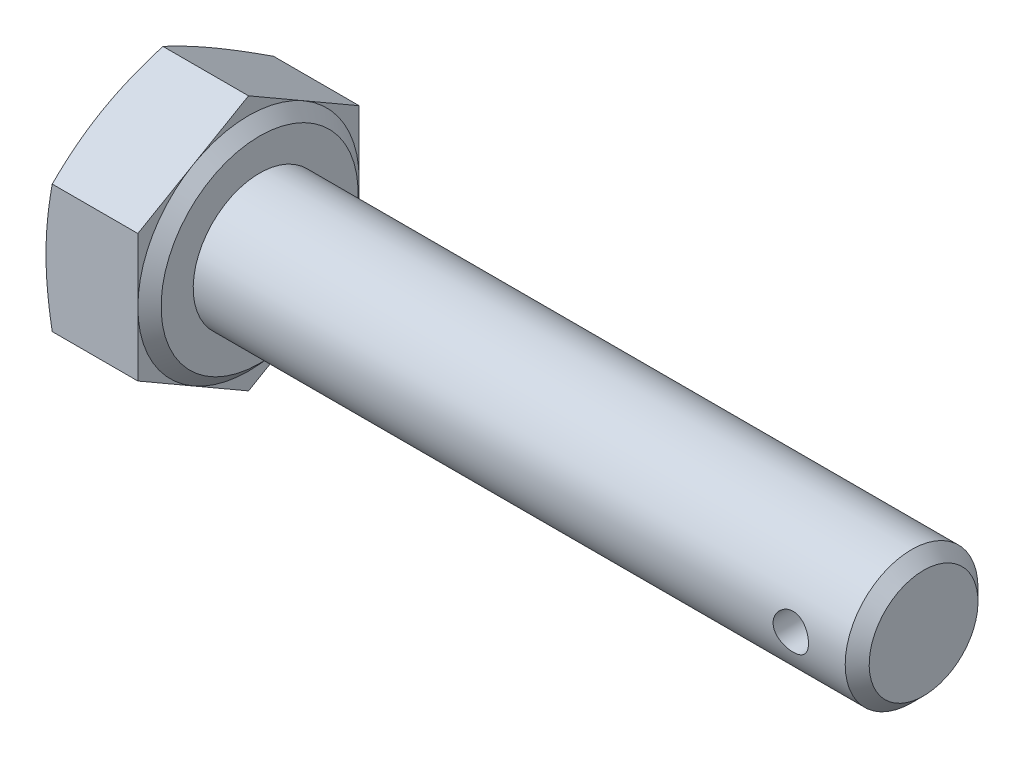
ISO-10303-21;
HEADER;
FILE_DESCRIPTION(('STEP AP214'),'2;1');
FILE_NAME('part.step','',(''),(''),'','','');
FILE_SCHEMA(('AUTOMOTIVE_DESIGN { 1 0 10303 214 1 1 1 1 }'));
ENDSEC;
DATA;
#1=APPLICATION_CONTEXT('core data for automotive mechanical design processes');
#2=APPLICATION_PROTOCOL_DEFINITION('international standard','automotive_design',2000,#1);
#3=PRODUCT_CONTEXT('',#1,'mechanical');
#4=PRODUCT('Part','Part','',(#3));
#5=PRODUCT_RELATED_PRODUCT_CATEGORY('part','',(#4));
#6=PRODUCT_DEFINITION_FORMATION('','',#4);
#7=PRODUCT_DEFINITION_CONTEXT('part definition',#1,'design');
#8=PRODUCT_DEFINITION('design','',#6,#7);
#9=PRODUCT_DEFINITION_SHAPE('','',#8);
#10=(LENGTH_UNIT() NAMED_UNIT(*) SI_UNIT(.MILLI.,.METRE.));
#11=(NAMED_UNIT(*) PLANE_ANGLE_UNIT() SI_UNIT($,.RADIAN.));
#12=(NAMED_UNIT(*) SI_UNIT($,.STERADIAN.) SOLID_ANGLE_UNIT());
#13=UNCERTAINTY_MEASURE_WITH_UNIT(LENGTH_MEASURE(1.E-05),#10,'distance_accuracy_value','');
#14=(GEOMETRIC_REPRESENTATION_CONTEXT(3) GLOBAL_UNCERTAINTY_ASSIGNED_CONTEXT((#13)) GLOBAL_UNIT_ASSIGNED_CONTEXT((#10,
#11,#12)) REPRESENTATION_CONTEXT('',''));
#15=CARTESIAN_POINT('',(0.,0.,0.));
#16=DIRECTION('',(0.,0.,1.));
#17=DIRECTION('',(1.,0.,0.));
#18=AXIS2_PLACEMENT_3D('',#15,#16,#17);
#19=CARTESIAN_POINT('',(4.65,0.,0.));
#20=DIRECTION('',(-1.,0.,0.));
#21=DIRECTION('',(0.,-1.,0.));
#22=AXIS2_PLACEMENT_3D('',#19,#20,#21);
#23=PLANE('',#22);
#24=CARTESIAN_POINT('',(4.65,0.,0.));
#25=DIRECTION('',(-1.,0.,0.));
#26=DIRECTION('',(0.,-1.,0.));
#27=AXIS2_PLACEMENT_3D('',#24,#25,#26);
#28=CIRCLE('',#27,4.45);
#29=CARTESIAN_POINT('',(4.65,-4.44999999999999,0.));
#30=VERTEX_POINT('',#29);
#31=EDGE_CURVE('E150',#30,#30,#28,.T.);
#32=ORIENTED_EDGE('',*,*,#31,.F.);
#33=EDGE_LOOP('',(#32));
#34=FACE_BOUND('',#33,.T.);
#35=CARTESIAN_POINT('',(4.65,0.,0.));
#36=DIRECTION('',(-1.,0.,0.));
#37=DIRECTION('',(0.,-1.,0.));
#38=AXIS2_PLACEMENT_3D('',#35,#36,#37);
#39=CIRCLE('',#38,3.);
#40=CARTESIAN_POINT('',(4.65,-3.,0.));
#41=VERTEX_POINT('',#40);
#42=EDGE_CURVE('E140',#41,#41,#39,.F.);
#43=ORIENTED_EDGE('',*,*,#42,.F.);
#44=EDGE_LOOP('',(#43));
#45=FACE_BOUND('',#44,.T.);
#46=ADVANCED_FACE('F37',(#34,#45),#23,.F.);
#47=CARTESIAN_POINT('',(4.15,-8.66025403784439,-5.));
#48=DIRECTION('',(1.,0.,0.));
#49=DIRECTION('',(0.,0.,-1.));
#50=AXIS2_PLACEMENT_3D('',#47,#48,#49);
#51=PLANE('',#50);
#52=DIRECTION('',(0.,-0.5,-0.866025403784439));
#53=VECTOR('',#52,1.);
#54=CARTESIAN_POINT('',(4.15,-2.88675134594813,5.));
#55=LINE('',#54,#53);
#56=CARTESIAN_POINT('',(4.15,-2.88675134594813,5.));
#57=VERTEX_POINT('',#56);
#58=CARTESIAN_POINT('',(4.15,-4.33012701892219,2.5));
#59=VERTEX_POINT('',#58);
#60=EDGE_CURVE('E149',#57,#59,#55,.T.);
#61=ORIENTED_EDGE('',*,*,#60,.T.);
#62=CARTESIAN_POINT('',(4.15,0.,0.));
#63=DIRECTION('',(-1.,0.,0.));
#64=DIRECTION('',(0.,-1.,0.));
#65=AXIS2_PLACEMENT_3D('',#62,#63,#64);
#66=CIRCLE('',#65,5.);
#67=CARTESIAN_POINT('',(4.15,0.,5.));
#68=VERTEX_POINT('',#67);
#69=EDGE_CURVE('E59',#59,#68,#66,.T.);
#70=ORIENTED_EDGE('',*,*,#69,.T.);
#71=DIRECTION('',(0.,-1.,0.));
#72=VECTOR('',#71,1.);
#73=CARTESIAN_POINT('',(4.15,2.88675134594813,5.));
#74=LINE('',#73,#72);
#75=EDGE_CURVE('E146',#68,#57,#74,.T.);
#76=ORIENTED_EDGE('',*,*,#75,.T.);
#77=EDGE_LOOP('',(#61,#70,#76));
#78=FACE_BOUND('',#77,.T.);
#79=ADVANCED_FACE('F145',(#78),#51,.T.);
#80=CARTESIAN_POINT('',(4.15,2.88675134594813,5.));
#81=VERTEX_POINT('',#80);
#82=EDGE_CURVE('E157',#81,#68,#74,.T.);
#83=ORIENTED_EDGE('',*,*,#82,.T.);
#84=CARTESIAN_POINT('',(4.15,4.3301270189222,2.5));
#85=VERTEX_POINT('',#84);
#86=EDGE_CURVE('E132',#68,#85,#66,.T.);
#87=ORIENTED_EDGE('',*,*,#86,.T.);
#88=DIRECTION('',(0.,-0.5,0.866025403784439));
#89=VECTOR('',#88,1.);
#90=CARTESIAN_POINT('',(4.15,5.77350269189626,0.));
#91=LINE('',#90,#89);
#92=EDGE_CURVE('E163',#85,#81,#91,.T.);
#93=ORIENTED_EDGE('',*,*,#92,.T.);
#94=EDGE_LOOP('',(#83,#87,#93));
#95=FACE_BOUND('',#94,.T.);
#96=ADVANCED_FACE('F162',(#95),#51,.T.);
#97=CARTESIAN_POINT('',(4.15,5.77350269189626,0.));
#98=VERTEX_POINT('',#97);
#99=EDGE_CURVE('E160',#98,#85,#91,.T.);
#100=ORIENTED_EDGE('',*,*,#99,.T.);
#101=CARTESIAN_POINT('',(4.15,4.3301270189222,-2.5));
#102=VERTEX_POINT('',#101);
#103=EDGE_CURVE('E136',#85,#102,#66,.T.);
#104=ORIENTED_EDGE('',*,*,#103,.T.);
#105=DIRECTION('',(0.,0.5,0.866025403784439));
#106=VECTOR('',#105,1.);
#107=CARTESIAN_POINT('',(4.15,2.88675134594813,-5.));
#108=LINE('',#107,#106);
#109=EDGE_CURVE('E318',#102,#98,#108,.T.);
#110=ORIENTED_EDGE('',*,*,#109,.T.);
#111=EDGE_LOOP('',(#100,#104,#110));
#112=FACE_BOUND('',#111,.T.);
#113=ADVANCED_FACE('F328',(#112),#51,.T.);
#114=CARTESIAN_POINT('',(4.15,2.88675134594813,-5.));
#115=VERTEX_POINT('',#114);
#116=EDGE_CURVE('E319',#115,#102,#108,.T.);
#117=ORIENTED_EDGE('',*,*,#116,.T.);
#118=CARTESIAN_POINT('',(4.15,0.,-5.));
#119=VERTEX_POINT('',#118);
#120=EDGE_CURVE('E385',#102,#119,#66,.T.);
#121=ORIENTED_EDGE('',*,*,#120,.T.);
#122=DIRECTION('',(0.,1.,0.));
#123=VECTOR('',#122,1.);
#124=CARTESIAN_POINT('',(4.15,-2.88675134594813,-5.));
#125=LINE('',#124,#123);
#126=EDGE_CURVE('E313',#119,#115,#125,.T.);
#127=ORIENTED_EDGE('',*,*,#126,.T.);
#128=EDGE_LOOP('',(#117,#121,#127));
#129=FACE_BOUND('',#128,.T.);
#130=ADVANCED_FACE('F387',(#129),#51,.T.);
#131=CARTESIAN_POINT('',(4.15,-2.88675134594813,-5.));
#132=VERTEX_POINT('',#131);
#133=EDGE_CURVE('E315',#132,#119,#125,.T.);
#134=ORIENTED_EDGE('',*,*,#133,.T.);
#135=CARTESIAN_POINT('',(4.15,-4.33012701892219,-2.5));
#136=VERTEX_POINT('',#135);
#137=EDGE_CURVE('E383',#119,#136,#66,.T.);
#138=ORIENTED_EDGE('',*,*,#137,.T.);
#139=DIRECTION('',(0.,0.5,-0.866025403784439));
#140=VECTOR('',#139,1.);
#141=CARTESIAN_POINT('',(4.15,-5.77350269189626,0.));
#142=LINE('',#141,#140);
#143=EDGE_CURVE('E312',#136,#132,#142,.T.);
#144=ORIENTED_EDGE('',*,*,#143,.T.);
#145=EDGE_LOOP('',(#134,#138,#144));
#146=FACE_BOUND('',#145,.T.);
#147=ADVANCED_FACE('F295',(#146),#51,.T.);
#148=CARTESIAN_POINT('',(4.15,-5.77350269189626,0.));
#149=VERTEX_POINT('',#148);
#150=EDGE_CURVE('E310',#149,#136,#142,.T.);
#151=ORIENTED_EDGE('',*,*,#150,.T.);
#152=EDGE_CURVE('E151',#136,#59,#66,.T.);
#153=ORIENTED_EDGE('',*,*,#152,.T.);
#154=EDGE_CURVE('E374',#59,#149,#55,.T.);
#155=ORIENTED_EDGE('',*,*,#154,.T.);
#156=EDGE_LOOP('',(#151,#153,#155));
#157=FACE_BOUND('',#156,.T.);
#158=ADVANCED_FACE('F221',(#157),#51,.T.);
#159=CARTESIAN_POINT('',(4.15,-2.88675134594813,5.));
#160=DIRECTION('',(0.,0.866025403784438,-0.5));
#161=DIRECTION('',(0.,0.5,0.866025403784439));
#162=AXIS2_PLACEMENT_3D('',#159,#160,#161);
#163=PLANE('',#162);
#164=CARTESIAN_POINT('',(0.281573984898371,-5.7736181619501,-0.000199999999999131));
#165=CARTESIAN_POINT('',(0.238042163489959,-5.65406193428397,0.206877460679));
#166=CARTESIAN_POINT('',(0.198442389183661,-5.5341114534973,0.414637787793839));
#167=CARTESIAN_POINT('',(0.128772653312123,-5.29343053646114,0.831509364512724));
#168=CARTESIAN_POINT('',(0.0987101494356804,-5.17269956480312,1.04062154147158));
#169=CARTESIAN_POINT('',(0.0500848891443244,-4.93179754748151,1.45787607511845));
#170=CARTESIAN_POINT('',(0.0314160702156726,-4.81163200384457,1.66600890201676));
#171=CARTESIAN_POINT('',(0.00637593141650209,-4.57101989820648,2.08276129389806));
#172=CARTESIAN_POINT('',(0.,-4.45057345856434,2.29138064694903));
#173=CARTESIAN_POINT('',(0.,-4.20968057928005,2.70861935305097));
#174=CARTESIAN_POINT('',(0.00637593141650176,-4.08923413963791,2.91723870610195));
#175=CARTESIAN_POINT('',(0.0314160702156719,-3.84862203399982,3.33399109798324));
#176=CARTESIAN_POINT('',(0.0500848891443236,-3.72845649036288,3.54212392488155));
#177=CARTESIAN_POINT('',(0.0987101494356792,-3.48755447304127,3.95937845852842));
#178=CARTESIAN_POINT('',(0.128772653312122,-3.36682350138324,4.16849063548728));
#179=CARTESIAN_POINT('',(0.19844238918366,-3.12614258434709,4.58536221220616));
#180=CARTESIAN_POINT('',(0.238042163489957,-3.00619210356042,4.793122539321));
#181=CARTESIAN_POINT('',(0.28157398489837,-2.88663587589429,5.0002));
#182=B_SPLINE_CURVE_WITH_KNOTS('',3,(#164,#165,#166,#167,#168,#169,#170,#171,#172,#173,#174,
#175,#176,#177,#178,#179,#180,#181),.UNSPECIFIED.,.F.,.F.,(4,2,2,2,2,2,2,2,4),(0.,
0.729203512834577,1.45897583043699,2.18184682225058,2.90444658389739,3.6270463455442,
4.3499173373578,5.07968965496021,5.80889316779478),.UNSPECIFIED.);
#183=CARTESIAN_POINT('',(0.281531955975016,-5.77350269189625,0.));
#184=VERTEX_POINT('',#183);
#185=CARTESIAN_POINT('',(0.,-4.33012701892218,2.5));
#186=VERTEX_POINT('',#185);
#187=EDGE_CURVE('E300',#184,#186,#182,.T.);
#188=ORIENTED_EDGE('',*,*,#187,.F.);
#189=DIRECTION('',(-1.,0.,0.));
#190=VECTOR('',#189,1.);
#191=CARTESIAN_POINT('',(4.15,-5.77350269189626,0.));
#192=LINE('',#191,#190);
#193=EDGE_CURVE('E180',#149,#184,#192,.T.);
#194=ORIENTED_EDGE('',*,*,#193,.F.);
#195=ORIENTED_EDGE('',*,*,#154,.F.);
#196=ORIENTED_EDGE('',*,*,#60,.F.);
#197=DIRECTION('',(-1.,0.,0.));
#198=VECTOR('',#197,1.);
#199=CARTESIAN_POINT('',(4.15,-2.88675134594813,5.));
#200=LINE('',#199,#198);
#201=CARTESIAN_POINT('',(0.281531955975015,-2.88675134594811,5.));
#202=VERTEX_POINT('',#201);
#203=EDGE_CURVE('E159',#57,#202,#200,.T.);
#204=ORIENTED_EDGE('',*,*,#203,.T.);
#205=EDGE_CURVE('E256',#186,#202,#182,.T.);
#206=ORIENTED_EDGE('',*,*,#205,.F.);
#207=EDGE_LOOP('',(#188,#194,#195,#196,#204,#206));
#208=FACE_BOUND('',#207,.T.);
#209=ADVANCED_FACE('F286',(#208),#163,.F.);
#210=CARTESIAN_POINT('',(4.15,-5.77350269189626,0.));
#211=DIRECTION('',(0.,0.866025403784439,0.5));
#212=DIRECTION('',(0.,-0.5,0.866025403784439));
#213=AXIS2_PLACEMENT_3D('',#210,#211,#212);
#214=PLANE('',#213);
#215=CARTESIAN_POINT('',(0.281573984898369,-2.8866358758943,-5.0002));
#216=CARTESIAN_POINT('',(0.238042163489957,-3.00619210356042,-4.793122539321));
#217=CARTESIAN_POINT('',(0.19844238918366,-3.1261425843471,-4.58536221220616));
#218=CARTESIAN_POINT('',(0.128772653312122,-3.36682350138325,-4.16849063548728));
#219=CARTESIAN_POINT('',(0.0987101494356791,-3.48755447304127,-3.95937845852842));
#220=CARTESIAN_POINT('',(0.0500848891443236,-3.72845649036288,-3.54212392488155));
#221=CARTESIAN_POINT('',(0.0314160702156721,-3.84862203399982,-3.33399109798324));
#222=CARTESIAN_POINT('',(0.00637593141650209,-4.08923413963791,-2.91723870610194));
#223=CARTESIAN_POINT('',(0.,-4.20968057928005,-2.70861935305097));
#224=CARTESIAN_POINT('',(0.,-4.45057345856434,-2.29138064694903));
#225=CARTESIAN_POINT('',(0.00637593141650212,-4.57101989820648,-2.08276129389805));
#226=CARTESIAN_POINT('',(0.0314160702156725,-4.81163200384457,-1.66600890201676));
#227=CARTESIAN_POINT('',(0.0500848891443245,-4.93179754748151,-1.45787607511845));
#228=CARTESIAN_POINT('',(0.0987101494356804,-5.17269956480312,-1.04062154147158));
#229=CARTESIAN_POINT('',(0.128772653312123,-5.29343053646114,-0.831509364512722));
#230=CARTESIAN_POINT('',(0.198442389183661,-5.5341114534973,-0.414637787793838));
#231=CARTESIAN_POINT('',(0.238042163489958,-5.65406193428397,-0.206877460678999));
#232=CARTESIAN_POINT('',(0.281573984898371,-5.7736181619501,0.000200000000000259));
#233=B_SPLINE_CURVE_WITH_KNOTS('',3,(#215,#216,#217,#218,#219,#220,#221,#222,#223,#224,#225,
#226,#227,#228,#229,#230,#231,#232),.UNSPECIFIED.,.F.,.F.,(4,2,2,2,2,2,2,2,4),(0.,
0.729203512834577,1.45897583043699,2.18184682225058,2.90444658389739,3.6270463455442,
4.34991733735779,5.0796896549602,5.80889316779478),.UNSPECIFIED.);
#234=CARTESIAN_POINT('',(0.281531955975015,-2.88675134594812,-5.));
#235=VERTEX_POINT('',#234);
#236=CARTESIAN_POINT('',(0.,-4.33012701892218,-2.5));
#237=VERTEX_POINT('',#236);
#238=EDGE_CURVE('E274',#235,#237,#233,.T.);
#239=ORIENTED_EDGE('',*,*,#238,.F.);
#240=DIRECTION('',(-1.,0.,0.));
#241=VECTOR('',#240,1.);
#242=CARTESIAN_POINT('',(4.15,-2.88675134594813,-5.));
#243=LINE('',#242,#241);
#244=EDGE_CURVE('E177',#132,#235,#243,.T.);
#245=ORIENTED_EDGE('',*,*,#244,.F.);
#246=ORIENTED_EDGE('',*,*,#143,.F.);
#247=ORIENTED_EDGE('',*,*,#150,.F.);
#248=ORIENTED_EDGE('',*,*,#193,.T.);
#249=EDGE_CURVE('E268',#237,#184,#233,.T.);
#250=ORIENTED_EDGE('',*,*,#249,.F.);
#251=EDGE_LOOP('',(#239,#245,#246,#247,#248,#250));
#252=FACE_BOUND('',#251,.T.);
#253=ADVANCED_FACE('F282',(#252),#214,.F.);
#254=CARTESIAN_POINT('',(4.15,-2.88675134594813,-5.));
#255=DIRECTION('',(0.,0.,1.));
#256=DIRECTION('',(1.,0.,0.));
#257=AXIS2_PLACEMENT_3D('',#254,#255,#256);
#258=PLANE('',#257);
#259=CARTESIAN_POINT('',(1.50439512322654,-7.64310251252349,-5.));
#260=CARTESIAN_POINT('',(1.43551180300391,-7.41688443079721,-5.));
#261=CARTESIAN_POINT('',(1.3674322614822,-7.19041704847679,-5.));
#262=CARTESIAN_POINT('',(1.23332538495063,-6.73685676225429,-5.));
#263=CARTESIAN_POINT('',(1.16729821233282,-6.50976381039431,-5.));
#264=CARTESIAN_POINT('',(1.03763088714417,-6.05443677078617,-5.));
#265=CARTESIAN_POINT('',(0.973995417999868,-5.82620134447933,-5.));
#266=CARTESIAN_POINT('',(0.849856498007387,-5.36888148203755,-5.));
#267=CARTESIAN_POINT('',(0.789352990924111,-5.13979706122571,-5.));
#268=CARTESIAN_POINT('',(0.672973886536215,-4.68345086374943,-5.));
#269=CARTESIAN_POINT('',(0.617050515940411,-4.45620133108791,-5.));
#270=CARTESIAN_POINT('',(0.509968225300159,-4.00058448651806,-5.));
#271=CARTESIAN_POINT('',(0.458809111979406,-3.77221722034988,-5.));
#272=CARTESIAN_POINT('',(0.362442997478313,-3.31429429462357,-5.));
#273=CARTESIAN_POINT('',(0.317234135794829,-3.08473902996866,-5.));
#274=CARTESIAN_POINT('',(0.234146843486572,-2.62429577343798,-5.));
#275=CARTESIAN_POINT('',(0.196268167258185,-2.3934078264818,-5.));
#276=CARTESIAN_POINT('',(0.133130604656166,-1.95629809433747,-5.));
#277=CARTESIAN_POINT('',(0.106932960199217,-1.75021318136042,-5.));
#278=CARTESIAN_POINT('',(0.0625865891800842,-1.33717192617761,-5.));
#279=CARTESIAN_POINT('',(0.0444376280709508,-1.13021560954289,-5.));
#280=CARTESIAN_POINT('',(0.0170626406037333,-0.71585133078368,-5.));
#281=CARTESIAN_POINT('',(0.00783030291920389,-0.508443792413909,-5.));
#282=CARTESIAN_POINT('',(-0.00124400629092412,-0.0934212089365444,-5.));
#283=CARTESIAN_POINT('',(-0.00108604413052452,0.1141938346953,-5.));
#284=CARTESIAN_POINT('',(0.00863625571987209,0.530253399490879,-5.));
#285=CARTESIAN_POINT('',(0.0182482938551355,0.738696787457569,-5.));
#286=CARTESIAN_POINT('',(0.0464363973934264,1.15497131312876,-5.));
#287=CARTESIAN_POINT('',(0.0650126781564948,1.3628024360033,-5.));
#288=CARTESIAN_POINT('',(0.110260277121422,1.77774980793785,-5.));
#289=CARTESIAN_POINT('',(0.136938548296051,1.98486528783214,-5.));
#290=CARTESIAN_POINT('',(0.197307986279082,2.39806009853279,-5.));
#291=CARTESIAN_POINT('',(0.230999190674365,2.60413942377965,-5.));
#292=CARTESIAN_POINT('',(0.30623674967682,3.02610647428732,-5.));
#293=CARTESIAN_POINT('',(0.348104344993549,3.24193641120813,-5.));
#294=CARTESIAN_POINT('',(0.437228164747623,3.67248794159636,-5.));
#295=CARTESIAN_POINT('',(0.484484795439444,3.88720945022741,-5.));
#296=CARTESIAN_POINT('',(0.583394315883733,4.3156971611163,-5.));
#297=CARTESIAN_POINT('',(0.635048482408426,4.52946306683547,-5.));
#298=CARTESIAN_POINT('',(0.741913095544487,4.95609429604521,-5.));
#299=CARTESIAN_POINT('',(0.797123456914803,5.16895964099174,-5.));
#300=CARTESIAN_POINT('',(0.910507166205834,5.59418863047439,-5.));
#301=CARTESIAN_POINT('',(0.968684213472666,5.8065512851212,-5.));
#302=CARTESIAN_POINT('',(1.0874086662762,6.23061420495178,-5.));
#303=CARTESIAN_POINT('',(1.14795610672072,6.44231446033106,-5.));
#304=CARTESIAN_POINT('',(1.33247422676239,7.07649472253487,-5.));
#305=CARTESIAN_POINT('',(1.45934162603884,7.49813135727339,-5.));
#306=CARTESIAN_POINT('',(1.71694117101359,8.33511686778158,-5.));
#307=CARTESIAN_POINT('',(1.84761520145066,8.75048377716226,-5.));
#308=CARTESIAN_POINT('',(2.1126779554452,9.58005025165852,-5.));
#309=CARTESIAN_POINT('',(2.24706685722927,9.99424975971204,-5.));
#310=CARTESIAN_POINT('',(2.51803451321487,10.8201887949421,-5.));
#311=CARTESIAN_POINT('',(2.65460302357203,11.2319316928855,-5.));
#312=CARTESIAN_POINT('',(2.9297876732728,12.0546955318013,-5.));
#313=CARTESIAN_POINT('',(3.06840364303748,12.4657165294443,-5.));
#314=CARTESIAN_POINT('',(3.20773627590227,12.8764911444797,-5.));
#315=B_SPLINE_CURVE_WITH_KNOTS('',3,(#259,#260,#261,#262,#263,#264,#265,#266,#267,#268,#269,
#270,#271,#272,#273,#274,#275,#276,#277,#278,#279,#280,#281,#282,#283,#284,#285,#286,#287,#288,
#289,#290,#291,#292,#293,#294,#295,#296,#297,#298,#299,#300,#301,#302,#303,#304,#305,#306,#307,
#308,#309,#310,#311,#312,#313,#314),.UNSPECIFIED.,.F.,.F.,(4,2,2,2,2,2,2,2,2,2,2,2,2,2,2,2,2,2,
2,2,2,2,2,2,2,2,2,4),(0.,0.709424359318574,1.4189047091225,2.12970877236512,2.8405000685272,
3.54254782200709,4.24456708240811,4.94636631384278,5.64814202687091,6.27123531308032,
6.89431044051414,7.51694422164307,8.13957360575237,8.76536065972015,9.39116274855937,
10.0175034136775,10.64384743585,11.3033228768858,11.9628480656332,12.6225653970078,
13.2822669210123,13.9428122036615,14.6033672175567,15.9242375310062,17.2305282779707,
18.5368818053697,19.8382785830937,21.139568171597),.UNSPECIFIED.);
#316=CARTESIAN_POINT('',(0.281531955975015,2.88675134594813,-5.));
#317=VERTEX_POINT('',#316);
#318=CARTESIAN_POINT('',(0.,0.,-4.99999999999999));
#319=VERTEX_POINT('',#318);
#320=EDGE_CURVE('E372',#317,#319,#315,.F.);
#321=ORIENTED_EDGE('',*,*,#320,.F.);
#322=DIRECTION('',(-1.,0.,0.));
#323=VECTOR('',#322,1.);
#324=CARTESIAN_POINT('',(4.15,2.88675134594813,-5.));
#325=LINE('',#324,#323);
#326=EDGE_CURVE('E174',#115,#317,#325,.T.);
#327=ORIENTED_EDGE('',*,*,#326,.F.);
#328=ORIENTED_EDGE('',*,*,#126,.F.);
#329=ORIENTED_EDGE('',*,*,#133,.F.);
#330=ORIENTED_EDGE('',*,*,#244,.T.);
#331=EDGE_CURVE('E275',#319,#235,#315,.F.);
#332=ORIENTED_EDGE('',*,*,#331,.F.);
#333=EDGE_LOOP('',(#321,#327,#328,#329,#330,#332));
#334=FACE_BOUND('',#333,.T.);
#335=ADVANCED_FACE('F285',(#334),#258,.F.);
#336=CARTESIAN_POINT('',(4.15,2.88675134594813,-5.));
#337=DIRECTION('',(0.,-0.866025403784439,0.5));
#338=DIRECTION('',(0.,-0.5,-0.866025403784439));
#339=AXIS2_PLACEMENT_3D('',#336,#337,#338);
#340=PLANE('',#339);
#341=CARTESIAN_POINT('',(0.281573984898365,5.7736181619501,0.000200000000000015));
#342=CARTESIAN_POINT('',(0.238042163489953,5.65406193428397,-0.206877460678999));
#343=CARTESIAN_POINT('',(0.198442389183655,5.5341114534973,-0.414637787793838));
#344=CARTESIAN_POINT('',(0.128772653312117,5.29343053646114,-0.831509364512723));
#345=CARTESIAN_POINT('',(0.0987101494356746,5.17269956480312,-1.04062154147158));
#346=CARTESIAN_POINT('',(0.0500848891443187,4.93179754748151,-1.45787607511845));
#347=CARTESIAN_POINT('',(0.0314160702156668,4.81163200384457,-1.66600890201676));
#348=CARTESIAN_POINT('',(0.00637593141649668,4.57101989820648,-2.08276129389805));
#349=CARTESIAN_POINT('',(0.,4.45057345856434,-2.29138064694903));
#350=CARTESIAN_POINT('',(0.,4.20968057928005,-2.70861935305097));
#351=CARTESIAN_POINT('',(0.00637593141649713,4.08923413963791,-2.91723870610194));
#352=CARTESIAN_POINT('',(0.0314160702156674,3.84862203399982,-3.33399109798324));
#353=CARTESIAN_POINT('',(0.0500848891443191,3.72845649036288,-3.54212392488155));
#354=CARTESIAN_POINT('',(0.0987101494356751,3.48755447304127,-3.95937845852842));
#355=CARTESIAN_POINT('',(0.128772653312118,3.36682350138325,-4.16849063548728));
#356=CARTESIAN_POINT('',(0.198442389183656,3.1261425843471,-4.58536221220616));
#357=CARTESIAN_POINT('',(0.238042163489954,3.00619210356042,-4.793122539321));
#358=CARTESIAN_POINT('',(0.281573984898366,2.88663587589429,-5.0002));
#359=B_SPLINE_CURVE_WITH_KNOTS('',3,(#341,#342,#343,#344,#345,#346,#347,#348,#349,#350,#351,
#352,#353,#354,#355,#356,#357,#358),.UNSPECIFIED.,.F.,.F.,(4,2,2,2,2,2,2,2,4),(0.,
0.729203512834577,1.45897583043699,2.18184682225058,2.90444658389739,3.6270463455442,
4.34991733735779,5.0796896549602,5.80889316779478),.UNSPECIFIED.);
#360=CARTESIAN_POINT('',(0.281531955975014,5.77350269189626,0.));
#361=VERTEX_POINT('',#360);
#362=CARTESIAN_POINT('',(0.,4.33012701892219,-2.5));
#363=VERTEX_POINT('',#362);
#364=EDGE_CURVE('E67',#361,#363,#359,.T.);
#365=ORIENTED_EDGE('',*,*,#364,.F.);
#366=DIRECTION('',(-1.,0.,0.));
#367=VECTOR('',#366,1.);
#368=CARTESIAN_POINT('',(4.15,5.77350269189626,0.));
#369=LINE('',#368,#367);
#370=EDGE_CURVE('E171',#98,#361,#369,.T.);
#371=ORIENTED_EDGE('',*,*,#370,.F.);
#372=ORIENTED_EDGE('',*,*,#109,.F.);
#373=ORIENTED_EDGE('',*,*,#116,.F.);
#374=ORIENTED_EDGE('',*,*,#326,.T.);
#375=EDGE_CURVE('E375',#363,#317,#359,.T.);
#376=ORIENTED_EDGE('',*,*,#375,.F.);
#377=EDGE_LOOP('',(#365,#371,#372,#373,#374,#376));
#378=FACE_BOUND('',#377,.T.);
#379=ADVANCED_FACE('F331',(#378),#340,.F.);
#380=CARTESIAN_POINT('',(4.15,5.77350269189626,0.));
#381=DIRECTION('',(0.,-0.866025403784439,-0.5));
#382=DIRECTION('',(0.,0.5,-0.866025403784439));
#383=AXIS2_PLACEMENT_3D('',#380,#381,#382);
#384=PLANE('',#383);
#385=CARTESIAN_POINT('',(0.281573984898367,2.88663587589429,5.0002));
#386=CARTESIAN_POINT('',(0.238042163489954,3.00619210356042,4.793122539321));
#387=CARTESIAN_POINT('',(0.198442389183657,3.12614258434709,4.58536221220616));
#388=CARTESIAN_POINT('',(0.128772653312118,3.36682350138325,4.16849063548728));
#389=CARTESIAN_POINT('',(0.0987101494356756,3.48755447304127,3.95937845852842));
#390=CARTESIAN_POINT('',(0.0500848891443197,3.72845649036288,3.54212392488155));
#391=CARTESIAN_POINT('',(0.0314160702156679,3.84862203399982,3.33399109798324));
#392=CARTESIAN_POINT('',(0.00637593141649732,4.08923413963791,2.91723870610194));
#393=CARTESIAN_POINT('',(0.,4.20968057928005,2.70861935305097));
#394=CARTESIAN_POINT('',(0.,4.45057345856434,2.29138064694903));
#395=CARTESIAN_POINT('',(0.00637593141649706,4.57101989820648,2.08276129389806));
#396=CARTESIAN_POINT('',(0.0314160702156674,4.81163200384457,1.66600890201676));
#397=CARTESIAN_POINT('',(0.050084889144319,4.93179754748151,1.45787607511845));
#398=CARTESIAN_POINT('',(0.0987101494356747,5.17269956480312,1.04062154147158));
#399=CARTESIAN_POINT('',(0.128772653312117,5.29343053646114,0.831509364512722));
#400=CARTESIAN_POINT('',(0.198442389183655,5.5341114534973,0.414637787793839));
#401=CARTESIAN_POINT('',(0.238042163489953,5.65406193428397,0.206877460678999));
#402=CARTESIAN_POINT('',(0.281573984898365,5.7736181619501,-0.000200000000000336));
#403=B_SPLINE_CURVE_WITH_KNOTS('',3,(#385,#386,#387,#388,#389,#390,#391,#392,#393,#394,#395,
#396,#397,#398,#399,#400,#401,#402),.UNSPECIFIED.,.F.,.F.,(4,2,2,2,2,2,2,2,4),(0.,
0.729203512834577,1.45897583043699,2.18184682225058,2.90444658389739,3.6270463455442,
4.3499173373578,5.07968965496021,5.80889316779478),.UNSPECIFIED.);
#404=CARTESIAN_POINT('',(0.281531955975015,2.88675134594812,5.));
#405=VERTEX_POINT('',#404);
#406=CARTESIAN_POINT('',(0.,4.33012701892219,2.49999999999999));
#407=VERTEX_POINT('',#406);
#408=EDGE_CURVE('E248',#405,#407,#403,.T.);
#409=ORIENTED_EDGE('',*,*,#408,.F.);
#410=DIRECTION('',(-1.,0.,0.));
#411=VECTOR('',#410,1.);
#412=CARTESIAN_POINT('',(4.15,2.88675134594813,5.));
#413=LINE('',#412,#411);
#414=EDGE_CURVE('E165',#81,#405,#413,.T.);
#415=ORIENTED_EDGE('',*,*,#414,.F.);
#416=ORIENTED_EDGE('',*,*,#92,.F.);
#417=ORIENTED_EDGE('',*,*,#99,.F.);
#418=ORIENTED_EDGE('',*,*,#370,.T.);
#419=EDGE_CURVE('E304',#407,#361,#403,.T.);
#420=ORIENTED_EDGE('',*,*,#419,.F.);
#421=EDGE_LOOP('',(#409,#415,#416,#417,#418,#420));
#422=FACE_BOUND('',#421,.T.);
#423=ADVANCED_FACE('F336',(#422),#384,.F.);
#424=CARTESIAN_POINT('',(4.15,2.88675134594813,5.));
#425=DIRECTION('',(0.,0.,-1.));
#426=DIRECTION('',(-1.,0.,0.));
#427=AXIS2_PLACEMENT_3D('',#424,#425,#426);
#428=PLANE('',#427);
#429=CARTESIAN_POINT('',(1.50439512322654,-7.64310251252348,5.));
#430=CARTESIAN_POINT('',(1.43551180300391,-7.41688443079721,5.));
#431=CARTESIAN_POINT('',(1.3674322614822,-7.19041704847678,5.));
#432=CARTESIAN_POINT('',(1.23332538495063,-6.73685676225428,5.));
#433=CARTESIAN_POINT('',(1.16729821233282,-6.50976381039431,5.));
#434=CARTESIAN_POINT('',(1.03763088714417,-6.05443677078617,5.));
#435=CARTESIAN_POINT('',(0.973995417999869,-5.82620134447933,5.));
#436=CARTESIAN_POINT('',(0.849856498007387,-5.36888148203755,5.));
#437=CARTESIAN_POINT('',(0.789352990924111,-5.13979706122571,5.));
#438=CARTESIAN_POINT('',(0.672973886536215,-4.68345086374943,5.));
#439=CARTESIAN_POINT('',(0.617050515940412,-4.45620133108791,5.));
#440=CARTESIAN_POINT('',(0.50996822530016,-4.00058448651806,5.));
#441=CARTESIAN_POINT('',(0.458809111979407,-3.77221722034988,5.));
#442=CARTESIAN_POINT('',(0.362442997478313,-3.31429429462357,5.));
#443=CARTESIAN_POINT('',(0.31723413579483,-3.08473902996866,5.));
#444=CARTESIAN_POINT('',(0.234146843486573,-2.62429577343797,5.));
#445=CARTESIAN_POINT('',(0.196268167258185,-2.3934078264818,5.));
#446=CARTESIAN_POINT('',(0.133130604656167,-1.95629809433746,5.));
#447=CARTESIAN_POINT('',(0.106932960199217,-1.75021318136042,5.));
#448=CARTESIAN_POINT('',(0.062586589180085,-1.3371719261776,5.));
#449=CARTESIAN_POINT('',(0.0444376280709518,-1.13021560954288,5.));
#450=CARTESIAN_POINT('',(0.0170626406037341,-0.715851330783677,5.));
#451=CARTESIAN_POINT('',(0.00783030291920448,-0.508443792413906,5.));
#452=CARTESIAN_POINT('',(-0.00124400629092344,-0.0934212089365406,5.));
#453=CARTESIAN_POINT('',(-0.00108604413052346,0.114193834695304,5.));
#454=CARTESIAN_POINT('',(0.00863625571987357,0.530253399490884,5.));
#455=CARTESIAN_POINT('',(0.018248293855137,0.738696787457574,5.));
#456=CARTESIAN_POINT('',(0.046436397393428,1.15497131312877,5.));
#457=CARTESIAN_POINT('',(0.0650126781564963,1.36280243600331,5.));
#458=CARTESIAN_POINT('',(0.110260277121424,1.77774980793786,5.));
#459=CARTESIAN_POINT('',(0.136938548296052,1.98486528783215,5.));
#460=CARTESIAN_POINT('',(0.197307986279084,2.3980600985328,5.));
#461=CARTESIAN_POINT('',(0.230999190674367,2.60413942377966,5.));
#462=CARTESIAN_POINT('',(0.306236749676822,3.02610647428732,5.));
#463=CARTESIAN_POINT('',(0.348104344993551,3.24193641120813,5.));
#464=CARTESIAN_POINT('',(0.437228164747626,3.67248794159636,5.));
#465=CARTESIAN_POINT('',(0.484484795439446,3.88720945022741,5.));
#466=CARTESIAN_POINT('',(0.583394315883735,4.3156971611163,5.));
#467=CARTESIAN_POINT('',(0.635048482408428,4.52946306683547,5.));
#468=CARTESIAN_POINT('',(0.741913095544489,4.95609429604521,5.));
#469=CARTESIAN_POINT('',(0.797123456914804,5.16895964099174,5.));
#470=CARTESIAN_POINT('',(0.910507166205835,5.59418863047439,5.));
#471=CARTESIAN_POINT('',(0.968684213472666,5.8065512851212,5.));
#472=CARTESIAN_POINT('',(1.0874086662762,6.23061420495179,5.));
#473=CARTESIAN_POINT('',(1.14795610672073,6.44231446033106,5.));
#474=CARTESIAN_POINT('',(1.33247422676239,7.07649472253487,5.));
#475=CARTESIAN_POINT('',(1.45934162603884,7.49813135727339,5.));
#476=CARTESIAN_POINT('',(1.71694117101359,8.33511686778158,5.));
#477=CARTESIAN_POINT('',(1.84761520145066,8.75048377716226,5.));
#478=CARTESIAN_POINT('',(2.1126779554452,9.58005025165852,5.));
#479=CARTESIAN_POINT('',(2.24706685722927,9.99424975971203,5.));
#480=CARTESIAN_POINT('',(2.51803451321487,10.8201887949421,5.));
#481=CARTESIAN_POINT('',(2.65460302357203,11.2319316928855,5.));
#482=CARTESIAN_POINT('',(2.9297876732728,12.0546955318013,5.));
#483=CARTESIAN_POINT('',(3.06840364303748,12.4657165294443,5.));
#484=CARTESIAN_POINT('',(3.20773627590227,12.8764911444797,5.));
#485=B_SPLINE_CURVE_WITH_KNOTS('',3,(#429,#430,#431,#432,#433,#434,#435,#436,#437,#438,#439,
#440,#441,#442,#443,#444,#445,#446,#447,#448,#449,#450,#451,#452,#453,#454,#455,#456,#457,#458,
#459,#460,#461,#462,#463,#464,#465,#466,#467,#468,#469,#470,#471,#472,#473,#474,#475,#476,#477,
#478,#479,#480,#481,#482,#483,#484),.UNSPECIFIED.,.F.,.F.,(4,2,2,2,2,2,2,2,2,2,2,2,2,2,2,2,2,2,
2,2,2,2,2,2,2,2,2,4),(0.,0.709424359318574,1.4189047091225,2.12970877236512,2.8405000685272,
3.54254782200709,4.2445670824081,4.94636631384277,5.64814202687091,6.27123531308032,
6.89431044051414,7.51694422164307,8.13957360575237,8.76536065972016,9.39116274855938,
10.0175034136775,10.64384743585,11.3033228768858,11.9628480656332,12.6225653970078,
13.2822669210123,13.9428122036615,14.6033672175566,15.9242375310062,17.2305282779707,
18.5368818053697,19.8382785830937,21.139568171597),.UNSPECIFIED.);
#486=CARTESIAN_POINT('',(0.,0.,5.));
#487=VERTEX_POINT('',#486);
#488=EDGE_CURVE('E339',#202,#487,#485,.T.);
#489=ORIENTED_EDGE('',*,*,#488,.F.);
#490=ORIENTED_EDGE('',*,*,#203,.F.);
#491=ORIENTED_EDGE('',*,*,#75,.F.);
#492=ORIENTED_EDGE('',*,*,#82,.F.);
#493=ORIENTED_EDGE('',*,*,#414,.T.);
#494=EDGE_CURVE('E237',#487,#405,#485,.T.);
#495=ORIENTED_EDGE('',*,*,#494,.F.);
#496=EDGE_LOOP('',(#489,#490,#491,#492,#493,#495));
#497=FACE_BOUND('',#496,.T.);
#498=ADVANCED_FACE('F155',(#497),#428,.F.);
#499=CARTESIAN_POINT('',(0.,0.,0.));
#500=DIRECTION('',(1.,0.,0.));
#501=DIRECTION('',(0.,1.,0.));
#502=AXIS2_PLACEMENT_3D('',#499,#500,#501);
#503=CONICAL_SURFACE('',#502,4.99999999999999,1.22173047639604);
#504=ORIENTED_EDGE('',*,*,#331,.T.);
#505=ORIENTED_EDGE('',*,*,#238,.T.);
#506=CARTESIAN_POINT('',(0.,0.,0.));
#507=DIRECTION('',(1.,0.,0.));
#508=DIRECTION('',(0.,0.,-1.));
#509=AXIS2_PLACEMENT_3D('',#506,#507,#508);
#510=CIRCLE('',#509,4.99999999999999);
#511=EDGE_CURVE('E183',#237,#319,#510,.T.);
#512=ORIENTED_EDGE('',*,*,#511,.T.);
#513=EDGE_LOOP('',(#504,#505,#512));
#514=FACE_BOUND('',#513,.T.);
#515=ADVANCED_FACE('F231',(#514),#503,.T.);
#516=ORIENTED_EDGE('',*,*,#249,.T.);
#517=ORIENTED_EDGE('',*,*,#187,.T.);
#518=EDGE_CURVE('E186',#186,#237,#510,.T.);
#519=ORIENTED_EDGE('',*,*,#518,.T.);
#520=EDGE_LOOP('',(#516,#517,#519));
#521=FACE_BOUND('',#520,.T.);
#522=ADVANCED_FACE('F391',(#521),#503,.T.);
#523=ORIENTED_EDGE('',*,*,#205,.T.);
#524=ORIENTED_EDGE('',*,*,#488,.T.);
#525=CARTESIAN_POINT('',(0.,0.,0.));
#526=DIRECTION('',(-1.,0.,0.));
#527=DIRECTION('',(0.,-1.,0.));
#528=AXIS2_PLACEMENT_3D('',#525,#526,#527);
#529=CIRCLE('',#528,4.99999999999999);
#530=EDGE_CURVE('E342',#186,#487,#529,.T.);
#531=ORIENTED_EDGE('',*,*,#530,.F.);
#532=EDGE_LOOP('',(#523,#524,#531));
#533=FACE_BOUND('',#532,.T.);
#534=ADVANCED_FACE('F378',(#533),#503,.T.);
#535=ORIENTED_EDGE('',*,*,#408,.T.);
#536=EDGE_CURVE('E380',#407,#487,#510,.T.);
#537=ORIENTED_EDGE('',*,*,#536,.T.);
#538=ORIENTED_EDGE('',*,*,#494,.T.);
#539=EDGE_LOOP('',(#535,#537,#538));
#540=FACE_BOUND('',#539,.T.);
#541=ADVANCED_FACE('F232',(#540),#503,.T.);
#542=ORIENTED_EDGE('',*,*,#364,.T.);
#543=EDGE_CURVE('E381',#363,#407,#510,.T.);
#544=ORIENTED_EDGE('',*,*,#543,.T.);
#545=ORIENTED_EDGE('',*,*,#419,.T.);
#546=EDGE_LOOP('',(#542,#544,#545));
#547=FACE_BOUND('',#546,.T.);
#548=ADVANCED_FACE('F229',(#547),#503,.T.);
#549=ORIENTED_EDGE('',*,*,#320,.T.);
#550=EDGE_CURVE('E187',#319,#363,#510,.T.);
#551=ORIENTED_EDGE('',*,*,#550,.T.);
#552=ORIENTED_EDGE('',*,*,#375,.T.);
#553=EDGE_LOOP('',(#549,#551,#552));
#554=FACE_BOUND('',#553,.T.);
#555=ADVANCED_FACE('F225',(#554),#503,.T.);
#556=CARTESIAN_POINT('',(0.,-8.66025403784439,-5.));
#557=DIRECTION('',(1.,0.,0.));
#558=DIRECTION('',(0.,0.,-1.));
#559=AXIS2_PLACEMENT_3D('',#556,#557,#558);
#560=PLANE('',#559);
#561=ORIENTED_EDGE('',*,*,#550,.F.);
#562=ORIENTED_EDGE('',*,*,#511,.F.);
#563=ORIENTED_EDGE('',*,*,#518,.F.);
#564=ORIENTED_EDGE('',*,*,#530,.T.);
#565=ORIENTED_EDGE('',*,*,#536,.F.);
#566=ORIENTED_EDGE('',*,*,#543,.F.);
#567=EDGE_LOOP('',(#561,#562,#563,#564,#565,#566));
#568=FACE_BOUND('',#567,.T.);
#569=ADVANCED_FACE('F228',(#568),#560,.F.);
#570=CARTESIAN_POINT('',(4.65,0.,0.));
#571=DIRECTION('',(-1.,0.,0.));
#572=DIRECTION('',(0.,-1.,0.));
#573=AXIS2_PLACEMENT_3D('',#570,#571,#572);
#574=CONICAL_SURFACE('',#573,4.45,0.832981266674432);
#575=ORIENTED_EDGE('',*,*,#69,.F.);
#576=ORIENTED_EDGE('',*,*,#152,.F.);
#577=ORIENTED_EDGE('',*,*,#137,.F.);
#578=ORIENTED_EDGE('',*,*,#120,.F.);
#579=ORIENTED_EDGE('',*,*,#103,.F.);
#580=ORIENTED_EDGE('',*,*,#86,.F.);
#581=EDGE_LOOP('',(#575,#576,#577,#578,#579,#580));
#582=FACE_BOUND('',#581,.T.);
#583=ORIENTED_EDGE('',*,*,#31,.T.);
#584=EDGE_LOOP('',(#583));
#585=FACE_BOUND('',#584,.T.);
#586=ADVANCED_FACE('F133',(#582,#585),#574,.T.);
#587=CARTESIAN_POINT('',(34.65,0.,0.));
#588=DIRECTION('',(-1.,0.,0.));
#589=DIRECTION('',(0.,-1.,0.));
#590=AXIS2_PLACEMENT_3D('',#587,#588,#589);
#591=CYLINDRICAL_SURFACE('',#590,3.);
#592=CARTESIAN_POINT('',(32.4499999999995,0.,-3.));
#593=CARTESIAN_POINT('',(32.4499989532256,0.0441018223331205,-2.99999933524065));
#594=CARTESIAN_POINT('',(32.4463409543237,0.0882148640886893,-2.99901794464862));
#595=CARTESIAN_POINT('',(32.4318315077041,0.175170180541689,-2.99519829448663));
#596=CARTESIAN_POINT('',(32.4209765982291,0.218011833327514,-2.99235914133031));
#597=CARTESIAN_POINT('',(32.3924513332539,0.301156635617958,-2.98513733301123));
#598=CARTESIAN_POINT('',(32.3747897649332,0.341462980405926,-2.98075666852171));
#599=CARTESIAN_POINT('',(32.333185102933,0.41854147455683,-2.97091479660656));
#600=CARTESIAN_POINT('',(32.3092415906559,0.455313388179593,-2.96545351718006));
#601=CARTESIAN_POINT('',(32.2551665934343,0.525131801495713,-2.95389845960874));
#602=CARTESIAN_POINT('',(32.2249165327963,0.55808467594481,-2.94779387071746));
#603=CARTESIAN_POINT('',(32.1593406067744,0.618514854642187,-2.93570963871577));
#604=CARTESIAN_POINT('',(32.124014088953,0.645991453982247,-2.92973001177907));
#605=CARTESIAN_POINT('',(32.0485407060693,0.695145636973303,-2.91846214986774));
#606=CARTESIAN_POINT('',(32.0083214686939,0.716715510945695,-2.91318755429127));
#607=CARTESIAN_POINT('',(31.9246639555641,0.752750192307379,-2.90408590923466));
#608=CARTESIAN_POINT('',(31.8812262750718,0.767216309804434,-2.90025859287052));
#609=CARTESIAN_POINT('',(31.7934017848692,0.788307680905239,-2.8945964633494));
#610=CARTESIAN_POINT('',(31.7490585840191,0.795102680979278,-2.89271859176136));
#611=CARTESIAN_POINT('',(31.6598249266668,0.801188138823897,-2.89103932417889));
#612=CARTESIAN_POINT('',(31.6149345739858,0.80047999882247,-2.89123754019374));
#613=CARTESIAN_POINT('',(31.5272058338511,0.791714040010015,-2.89364951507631));
#614=CARTESIAN_POINT('',(31.4843451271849,0.783861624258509,-2.89580694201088));
#615=CARTESIAN_POINT('',(31.4005726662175,0.761358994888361,-2.90180405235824));
#616=CARTESIAN_POINT('',(31.35966106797,0.746708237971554,-2.90564387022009));
#617=CARTESIAN_POINT('',(31.2804127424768,0.710857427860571,-2.91462264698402));
#618=CARTESIAN_POINT('',(31.2421102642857,0.689585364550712,-2.91977577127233));
#619=CARTESIAN_POINT('',(31.1695463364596,0.641146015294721,-2.93079291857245));
#620=CARTESIAN_POINT('',(31.1352856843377,0.613977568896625,-2.93665708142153));
#621=CARTESIAN_POINT('',(31.0706044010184,0.553466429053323,-2.9486700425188));
#622=CARTESIAN_POINT('',(31.0403454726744,0.519951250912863,-2.95482188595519));
#623=CARTESIAN_POINT('',(30.9858444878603,0.448247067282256,-2.9665455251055));
#624=CARTESIAN_POINT('',(30.9616026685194,0.410057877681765,-2.97211729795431));
#625=CARTESIAN_POINT('',(30.9197528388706,0.329839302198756,-2.98208728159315));
#626=CARTESIAN_POINT('',(30.902174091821,0.287793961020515,-2.98648029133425));
#627=CARTESIAN_POINT('',(30.8743811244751,0.201200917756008,-2.99356017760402));
#628=CARTESIAN_POINT('',(30.8641652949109,0.156653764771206,-2.996247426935));
#629=CARTESIAN_POINT('',(30.8516420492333,0.0677016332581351,-2.99955663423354));
#630=CARTESIAN_POINT('',(30.8491147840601,0.023329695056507,-3.00023598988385));
#631=CARTESIAN_POINT('',(30.8514332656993,-0.065204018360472,-2.99961788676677));
#632=CARTESIAN_POINT('',(30.8562782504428,-0.109365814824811,-2.99832063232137));
#633=CARTESIAN_POINT('',(30.8730233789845,-0.195440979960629,-2.99393214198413));
#634=CARTESIAN_POINT('',(30.8848008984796,-0.237379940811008,-2.99087210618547));
#635=CARTESIAN_POINT('',(30.9149343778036,-0.318682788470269,-2.98330517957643));
#636=CARTESIAN_POINT('',(30.9332910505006,-0.358046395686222,-2.97879813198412));
#637=CARTESIAN_POINT('',(30.9764695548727,-0.433935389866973,-2.9687026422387));
#638=CARTESIAN_POINT('',(31.0014109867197,-0.470390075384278,-2.96309474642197));
#639=CARTESIAN_POINT('',(31.0569006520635,-0.538673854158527,-2.9514458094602));
#640=CARTESIAN_POINT('',(31.0874499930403,-0.570502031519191,-2.94540468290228));
#641=CARTESIAN_POINT('',(31.1543142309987,-0.62955569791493,-2.93335898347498));
#642=CARTESIAN_POINT('',(31.1907674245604,-0.65662607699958,-2.9273602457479));
#643=CARTESIAN_POINT('',(31.2678258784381,-0.704268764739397,-2.91626578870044));
#644=CARTESIAN_POINT('',(31.3084309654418,-0.724841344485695,-2.91117003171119));
#645=CARTESIAN_POINT('',(31.3924381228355,-0.758749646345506,-2.90251707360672));
#646=CARTESIAN_POINT('',(31.4358223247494,-0.77212724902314,-2.89895099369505));
#647=CARTESIAN_POINT('',(31.5243357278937,-0.791364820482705,-2.89375930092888));
#648=CARTESIAN_POINT('',(31.5694644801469,-0.797226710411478,-2.89213319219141));
#649=CARTESIAN_POINT('',(31.6585979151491,-0.80115595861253,-2.89104697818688));
#650=CARTESIAN_POINT('',(31.7025909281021,-0.799472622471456,-2.89151759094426));
#651=CARTESIAN_POINT('',(31.7896414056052,-0.788937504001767,-2.89440958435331));
#652=CARTESIAN_POINT('',(31.8326988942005,-0.780085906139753,-2.89683091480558));
#653=CARTESIAN_POINT('',(31.9163423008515,-0.755610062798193,-2.90331028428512));
#654=CARTESIAN_POINT('',(31.9569447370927,-0.740038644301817,-2.90735554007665));
#655=CARTESIAN_POINT('',(32.0349915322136,-0.702606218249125,-2.91662727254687));
#656=CARTESIAN_POINT('',(32.07243539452,-0.680744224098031,-2.92185393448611));
#657=CARTESIAN_POINT('',(32.1442921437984,-0.630595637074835,-2.93309168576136));
#658=CARTESIAN_POINT('',(32.1785834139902,-0.602138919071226,-2.93912133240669));
#659=CARTESIAN_POINT('',(32.2419849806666,-0.539932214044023,-2.95118201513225));
#660=CARTESIAN_POINT('',(32.2710940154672,-0.506180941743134,-2.95721305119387));
#661=CARTESIAN_POINT('',(32.3239168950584,-0.433471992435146,-2.96875124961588));
#662=CARTESIAN_POINT('',(32.3475020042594,-0.394418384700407,-2.97424444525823));
#663=CARTESIAN_POINT('',(32.3877349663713,-0.312755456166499,-2.98393524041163));
#664=CARTESIAN_POINT('',(32.404387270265,-0.270148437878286,-2.9881336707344));
#665=CARTESIAN_POINT('',(32.4281101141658,-0.189749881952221,-2.99421901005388));
#666=CARTESIAN_POINT('',(32.4362997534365,-0.152304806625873,-2.99637108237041));
#667=CARTESIAN_POINT('',(32.4472448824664,-0.076575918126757,-2.99926179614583));
#668=CARTESIAN_POINT('',(32.4500009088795,-0.0382921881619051,-3.00000057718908));
#669=CARTESIAN_POINT('',(32.4499999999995,0.,-3.));
#670=B_SPLINE_CURVE_WITH_KNOTS('',3,(#592,#593,#594,#595,#596,#597,#598,#599,#600,#601,#602,
#603,#604,#605,#606,#607,#608,#609,#610,#611,#612,#613,#614,#615,#616,#617,#618,#619,#620,#621,
#622,#623,#624,#625,#626,#627,#628,#629,#630,#631,#632,#633,#634,#635,#636,#637,#638,#639,#640,
#641,#642,#643,#644,#645,#646,#647,#648,#649,#650,#651,#652,#653,#654,#655,#656,#657,#658,#659,
#660,#661,#662,#663,#664,#665,#666,#667,#668,#669),.UNSPECIFIED.,.T.,.F.,(4,2,2,2,2,2,2,2,2,2,2,
2,2,2,2,2,2,2,2,2,2,2,2,2,2,2,2,2,2,2,2,2,2,2,2,2,2,2,4),(0.,0.132165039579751,
0.264393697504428,0.396452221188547,0.5285195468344,0.663339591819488,0.798176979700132,
0.935330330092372,1.07245837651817,1.20648863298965,1.34049384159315,1.47076400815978,
1.60104458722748,1.73279469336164,1.86457075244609,2.00064503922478,2.1367246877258,
2.27339523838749,2.4100359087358,2.54273087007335,2.67541211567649,2.80581414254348,
2.9362303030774,3.06920114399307,3.20219827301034,3.33894598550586,3.47568799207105,
3.61162519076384,3.7475276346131,3.87897336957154,4.0104157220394,4.14084306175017,
4.27129086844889,4.40557735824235,4.53989649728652,4.67708900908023,4.81419330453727,
4.92895927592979,5.04371391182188),.UNSPECIFIED.);
#671=CARTESIAN_POINT('',(32.4499999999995,0.,-3.));
#672=VERTEX_POINT('',#671);
#673=EDGE_CURVE('E41',#672,#672,#670,.T.);
#674=ORIENTED_EDGE('',*,*,#673,.T.);
#675=EDGE_LOOP('',(#674));
#676=FACE_BOUND('',#675,.T.);
#677=CARTESIAN_POINT('',(32.4499999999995,0.,3.));
#678=CARTESIAN_POINT('',(32.4499989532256,-0.0441018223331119,2.99999933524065));
#679=CARTESIAN_POINT('',(32.4463409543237,-0.0882148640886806,2.99901794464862));
#680=CARTESIAN_POINT('',(32.4318315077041,-0.17517018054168,2.99519829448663));
#681=CARTESIAN_POINT('',(32.4209765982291,-0.218011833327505,2.99235914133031));
#682=CARTESIAN_POINT('',(32.3924513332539,-0.30115663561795,2.98513733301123));
#683=CARTESIAN_POINT('',(32.3747897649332,-0.341462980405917,2.98075666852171));
#684=CARTESIAN_POINT('',(32.333185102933,-0.418541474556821,2.97091479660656));
#685=CARTESIAN_POINT('',(32.3092415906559,-0.455313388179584,2.96545351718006));
#686=CARTESIAN_POINT('',(32.2551665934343,-0.525131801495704,2.95389845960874));
#687=CARTESIAN_POINT('',(32.2249165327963,-0.558084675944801,2.94779387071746));
#688=CARTESIAN_POINT('',(32.1593406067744,-0.618514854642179,2.93570963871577));
#689=CARTESIAN_POINT('',(32.124014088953,-0.645991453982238,2.92973001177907));
#690=CARTESIAN_POINT('',(32.0485407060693,-0.695145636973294,2.91846214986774));
#691=CARTESIAN_POINT('',(32.0083214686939,-0.716715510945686,2.91318755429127));
#692=CARTESIAN_POINT('',(31.9246639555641,-0.75275019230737,2.90408590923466));
#693=CARTESIAN_POINT('',(31.8812262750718,-0.767216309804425,2.90025859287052));
#694=CARTESIAN_POINT('',(31.7934017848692,-0.78830768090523,2.8945964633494));
#695=CARTESIAN_POINT('',(31.7490585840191,-0.795102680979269,2.89271859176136));
#696=CARTESIAN_POINT('',(31.6598249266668,-0.801188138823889,2.89103932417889));
#697=CARTESIAN_POINT('',(31.6149345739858,-0.800479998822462,2.89123754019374));
#698=CARTESIAN_POINT('',(31.5272058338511,-0.791714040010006,2.89364951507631));
#699=CARTESIAN_POINT('',(31.4843451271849,-0.783861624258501,2.89580694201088));
#700=CARTESIAN_POINT('',(31.4005726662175,-0.761358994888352,2.90180405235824));
#701=CARTESIAN_POINT('',(31.35966106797,-0.746708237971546,2.90564387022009));
#702=CARTESIAN_POINT('',(31.2804127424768,-0.710857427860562,2.91462264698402));
#703=CARTESIAN_POINT('',(31.2421102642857,-0.689585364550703,2.91977577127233));
#704=CARTESIAN_POINT('',(31.1695463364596,-0.641146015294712,2.93079291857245));
#705=CARTESIAN_POINT('',(31.1352856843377,-0.613977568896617,2.93665708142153));
#706=CARTESIAN_POINT('',(31.0706044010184,-0.553466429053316,2.9486700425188));
#707=CARTESIAN_POINT('',(31.0403454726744,-0.519951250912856,2.95482188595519));
#708=CARTESIAN_POINT('',(30.9858444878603,-0.44824706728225,2.9665455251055));
#709=CARTESIAN_POINT('',(30.9616026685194,-0.410057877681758,2.97211729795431));
#710=CARTESIAN_POINT('',(30.9197528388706,-0.329839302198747,2.98208728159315));
#711=CARTESIAN_POINT('',(30.902174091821,-0.287793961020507,2.98648029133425));
#712=CARTESIAN_POINT('',(30.8743811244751,-0.201200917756,2.99356017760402));
#713=CARTESIAN_POINT('',(30.8641652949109,-0.156653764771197,2.996247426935));
#714=CARTESIAN_POINT('',(30.8516420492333,-0.0677016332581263,2.99955663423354));
#715=CARTESIAN_POINT('',(30.8491147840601,-0.0233296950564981,3.00023598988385));
#716=CARTESIAN_POINT('',(30.8514332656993,0.0652040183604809,2.99961788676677));
#717=CARTESIAN_POINT('',(30.8562782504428,0.10936581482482,2.99832063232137));
#718=CARTESIAN_POINT('',(30.8730233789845,0.195440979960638,2.99393214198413));
#719=CARTESIAN_POINT('',(30.8848008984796,0.237379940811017,2.99087210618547));
#720=CARTESIAN_POINT('',(30.9149343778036,0.318682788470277,2.98330517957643));
#721=CARTESIAN_POINT('',(30.9332910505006,0.358046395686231,2.97879813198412));
#722=CARTESIAN_POINT('',(30.9764695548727,0.43393538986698,2.9687026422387));
#723=CARTESIAN_POINT('',(31.0014109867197,0.470390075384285,2.96309474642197));
#724=CARTESIAN_POINT('',(31.0569006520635,0.538673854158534,2.9514458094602));
#725=CARTESIAN_POINT('',(31.0874499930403,0.570502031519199,2.94540468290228));
#726=CARTESIAN_POINT('',(31.1543142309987,0.629555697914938,2.93335898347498));
#727=CARTESIAN_POINT('',(31.1907674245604,0.656626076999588,2.9273602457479));
#728=CARTESIAN_POINT('',(31.2678258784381,0.704268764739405,2.91626578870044));
#729=CARTESIAN_POINT('',(31.3084309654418,0.724841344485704,2.91117003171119));
#730=CARTESIAN_POINT('',(31.3924381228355,0.758749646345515,2.90251707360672));
#731=CARTESIAN_POINT('',(31.4358223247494,0.772127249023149,2.89895099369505));
#732=CARTESIAN_POINT('',(31.5243357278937,0.791364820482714,2.89375930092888));
#733=CARTESIAN_POINT('',(31.5694644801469,0.797226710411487,2.89213319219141));
#734=CARTESIAN_POINT('',(31.6585979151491,0.801155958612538,2.89104697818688));
#735=CARTESIAN_POINT('',(31.7025909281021,0.799472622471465,2.89151759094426));
#736=CARTESIAN_POINT('',(31.7896414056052,0.788937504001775,2.89440958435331));
#737=CARTESIAN_POINT('',(31.8326988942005,0.780085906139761,2.89683091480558));
#738=CARTESIAN_POINT('',(31.9163423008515,0.755610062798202,2.90331028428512));
#739=CARTESIAN_POINT('',(31.9569447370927,0.740038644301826,2.90735554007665));
#740=CARTESIAN_POINT('',(32.0349915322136,0.702606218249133,2.91662727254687));
#741=CARTESIAN_POINT('',(32.07243539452,0.680744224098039,2.92185393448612));
#742=CARTESIAN_POINT('',(32.1442921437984,0.630595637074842,2.93309168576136));
#743=CARTESIAN_POINT('',(32.1785834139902,0.602138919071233,2.93912133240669));
#744=CARTESIAN_POINT('',(32.2419849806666,0.539932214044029,2.95118201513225));
#745=CARTESIAN_POINT('',(32.2710940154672,0.506180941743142,2.95721305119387));
#746=CARTESIAN_POINT('',(32.3239168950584,0.433471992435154,2.96875124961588));
#747=CARTESIAN_POINT('',(32.3475020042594,0.394418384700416,2.97424444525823));
#748=CARTESIAN_POINT('',(32.3877349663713,0.312755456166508,2.98393524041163));
#749=CARTESIAN_POINT('',(32.404387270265,0.270148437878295,2.9881336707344));
#750=CARTESIAN_POINT('',(32.4281101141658,0.18974988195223,2.99421901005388));
#751=CARTESIAN_POINT('',(32.4362997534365,0.152304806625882,2.99637108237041));
#752=CARTESIAN_POINT('',(32.4472448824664,0.0765759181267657,2.99926179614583));
#753=CARTESIAN_POINT('',(32.4500009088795,0.0382921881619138,3.00000057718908));
#754=CARTESIAN_POINT('',(32.4499999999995,0.,3.));
#755=B_SPLINE_CURVE_WITH_KNOTS('',3,(#677,#678,#679,#680,#681,#682,#683,#684,#685,#686,#687,
#688,#689,#690,#691,#692,#693,#694,#695,#696,#697,#698,#699,#700,#701,#702,#703,#704,#705,#706,
#707,#708,#709,#710,#711,#712,#713,#714,#715,#716,#717,#718,#719,#720,#721,#722,#723,#724,#725,
#726,#727,#728,#729,#730,#731,#732,#733,#734,#735,#736,#737,#738,#739,#740,#741,#742,#743,#744,
#745,#746,#747,#748,#749,#750,#751,#752,#753,#754),.UNSPECIFIED.,.T.,.F.,(4,2,2,2,2,2,2,2,2,2,2,
2,2,2,2,2,2,2,2,2,2,2,2,2,2,2,2,2,2,2,2,2,2,2,2,2,2,2,4),(0.,0.132165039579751,
0.264393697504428,0.396452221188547,0.5285195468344,0.663339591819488,0.798176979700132,
0.935330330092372,1.07245837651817,1.20648863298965,1.34049384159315,1.47076400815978,
1.60104458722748,1.73279469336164,1.86457075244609,2.00064503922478,2.1367246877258,
2.27339523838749,2.4100359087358,2.54273087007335,2.67541211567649,2.80581414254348,
2.9362303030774,3.06920114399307,3.20219827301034,3.33894598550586,3.47568799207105,
3.61162519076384,3.7475276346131,3.87897336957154,4.0104157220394,4.14084306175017,
4.27129086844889,4.40557735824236,4.53989649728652,4.67708900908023,4.81419330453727,
4.92895927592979,5.04371391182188),.UNSPECIFIED.);
#756=CARTESIAN_POINT('',(32.4499999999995,0.,3.));
#757=VERTEX_POINT('',#756);
#758=EDGE_CURVE('E191',#757,#757,#755,.T.);
#759=ORIENTED_EDGE('',*,*,#758,.T.);
#760=EDGE_LOOP('',(#759));
#761=FACE_BOUND('',#760,.T.);
#762=CARTESIAN_POINT('',(34.1085,0.,0.));
#763=DIRECTION('',(1.,0.,0.));
#764=DIRECTION('',(0.,1.,0.));
#765=AXIS2_PLACEMENT_3D('',#762,#763,#764);
#766=CIRCLE('',#765,3.);
#767=CARTESIAN_POINT('',(34.1085,3.,0.));
#768=VERTEX_POINT('',#767);
#769=EDGE_CURVE('E11',#768,#768,#766,.F.);
#770=ORIENTED_EDGE('',*,*,#769,.T.);
#771=EDGE_LOOP('',(#770));
#772=FACE_BOUND('',#771,.T.);
#773=ORIENTED_EDGE('',*,*,#42,.T.);
#774=EDGE_LOOP('',(#773));
#775=FACE_BOUND('',#774,.T.);
#776=ADVANCED_FACE('F196',(#676,#761,#772,#775),#591,.T.);
#777=CARTESIAN_POINT('',(34.65,0.,0.));
#778=DIRECTION('',(1.,0.,0.));
#779=DIRECTION('',(0.,1.,0.));
#780=AXIS2_PLACEMENT_3D('',#777,#778,#779);
#781=PLANE('',#780);
#782=CARTESIAN_POINT('',(34.65,0.,0.));
#783=DIRECTION('',(1.,0.,0.));
#784=DIRECTION('',(0.,1.,0.));
#785=AXIS2_PLACEMENT_3D('',#782,#783,#784);
#786=CIRCLE('',#785,2.4585);
#787=CARTESIAN_POINT('',(34.65,2.4585,0.));
#788=VERTEX_POINT('',#787);
#789=EDGE_CURVE('E51',#788,#788,#786,.T.);
#790=ORIENTED_EDGE('',*,*,#789,.T.);
#791=EDGE_LOOP('',(#790));
#792=FACE_BOUND('',#791,.T.);
#793=ADVANCED_FACE('F204',(#792),#781,.T.);
#794=CARTESIAN_POINT('',(34.65,0.,0.));
#795=DIRECTION('',(-1.,0.,0.));
#796=DIRECTION('',(0.,-1.,0.));
#797=AXIS2_PLACEMENT_3D('',#794,#795,#796);
#798=CONICAL_SURFACE('',#797,2.4585,0.785398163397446);
#799=ORIENTED_EDGE('',*,*,#769,.F.);
#800=EDGE_LOOP('',(#799));
#801=FACE_BOUND('',#800,.T.);
#802=ORIENTED_EDGE('',*,*,#789,.F.);
#803=EDGE_LOOP('',(#802));
#804=FACE_BOUND('',#803,.T.);
#805=ADVANCED_FACE('F39',(#801,#804),#798,.T.);
#806=CARTESIAN_POINT('',(31.65,0.,-5.));
#807=DIRECTION('',(0.,0.,1.));
#808=DIRECTION('',(1.,0.,0.));
#809=AXIS2_PLACEMENT_3D('',#806,#807,#808);
#810=CYLINDRICAL_SURFACE('',#809,0.799999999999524);
#811=ORIENTED_EDGE('',*,*,#758,.F.);
#812=EDGE_LOOP('',(#811));
#813=FACE_BOUND('',#812,.T.);
#814=ORIENTED_EDGE('',*,*,#673,.F.);
#815=EDGE_LOOP('',(#814));
#816=FACE_BOUND('',#815,.T.);
#817=ADVANCED_FACE('F200',(#813,#816),#810,.F.);
#818=CLOSED_SHELL('',(#46,#79,#96,#113,#130,#147,#158,#209,#253,#335,#379,#423,#498,#515,#522,
#534,#541,#548,#555,#569,#586,#776,#793,#805,#817));
#819=MANIFOLD_SOLID_BREP('B2',#818);
#820=ADVANCED_BREP_SHAPE_REPRESENTATION('',(#18,#819),#14);
#821=SHAPE_DEFINITION_REPRESENTATION(#9,#820);
ENDSEC;
END-ISO-10303-21;
